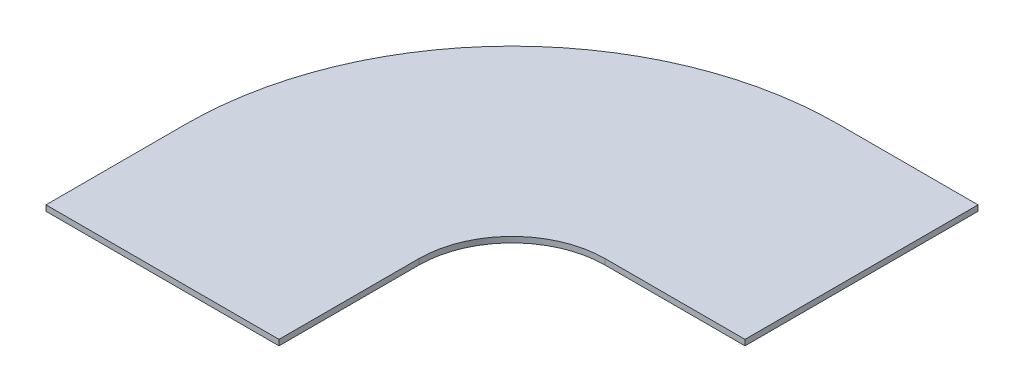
ISO-10303-21;
HEADER;
FILE_DESCRIPTION(('STEP AP214'),'2;1');
FILE_NAME('part.step','',(''),(''),'','','');
FILE_SCHEMA(('AUTOMOTIVE_DESIGN { 1 0 10303 214 1 1 1 1 }'));
ENDSEC;
DATA;
#1=APPLICATION_CONTEXT('core data for automotive mechanical design processes');
#2=APPLICATION_PROTOCOL_DEFINITION('international standard','automotive_design',2000,#1);
#3=PRODUCT_CONTEXT('',#1,'mechanical');
#4=PRODUCT('Part','Part','',(#3));
#5=PRODUCT_RELATED_PRODUCT_CATEGORY('part','',(#4));
#6=PRODUCT_DEFINITION_FORMATION('','',#4);
#7=PRODUCT_DEFINITION_CONTEXT('part definition',#1,'design');
#8=PRODUCT_DEFINITION('design','',#6,#7);
#9=PRODUCT_DEFINITION_SHAPE('','',#8);
#10=(LENGTH_UNIT() NAMED_UNIT(*) SI_UNIT(.MILLI.,.METRE.));
#11=(NAMED_UNIT(*) PLANE_ANGLE_UNIT() SI_UNIT($,.RADIAN.));
#12=(NAMED_UNIT(*) SI_UNIT($,.STERADIAN.) SOLID_ANGLE_UNIT());
#13=UNCERTAINTY_MEASURE_WITH_UNIT(LENGTH_MEASURE(1.E-05),#10,'distance_accuracy_value','');
#14=(GEOMETRIC_REPRESENTATION_CONTEXT(3) GLOBAL_UNCERTAINTY_ASSIGNED_CONTEXT((#13)) GLOBAL_UNIT_ASSIGNED_CONTEXT((#10,
#11,#12)) REPRESENTATION_CONTEXT('',''));
#15=CARTESIAN_POINT('',(0.,0.,0.));
#16=DIRECTION('',(0.,0.,1.));
#17=DIRECTION('',(1.,0.,0.));
#18=AXIS2_PLACEMENT_3D('',#15,#16,#17);
#19=CARTESIAN_POINT('',(50.,1.21412,0.));
#20=DIRECTION('',(0.,0.,-1.));
#21=DIRECTION('',(-1.,0.,0.));
#22=AXIS2_PLACEMENT_3D('',#19,#20,#21);
#23=PLANE('',#22);
#24=DIRECTION('',(1.,0.,0.));
#25=VECTOR('',#24,1.);
#26=CARTESIAN_POINT('',(50.,0.,0.));
#27=LINE('',#26,#25);
#28=CARTESIAN_POINT('',(0.,0.,0.));
#29=VERTEX_POINT('',#28);
#30=CARTESIAN_POINT('',(50.,0.,0.));
#31=VERTEX_POINT('',#30);
#32=EDGE_CURVE('E129',#29,#31,#27,.T.);
#33=ORIENTED_EDGE('',*,*,#32,.T.);
#34=DIRECTION('',(0.,-1.,0.));
#35=VECTOR('',#34,1.);
#36=CARTESIAN_POINT('',(50.,1.21412,0.));
#37=LINE('',#36,#35);
#38=CARTESIAN_POINT('',(50.,1.21412,0.));
#39=VERTEX_POINT('',#38);
#40=EDGE_CURVE('E11',#39,#31,#37,.T.);
#41=ORIENTED_EDGE('',*,*,#40,.F.);
#42=DIRECTION('',(1.,0.,0.));
#43=VECTOR('',#42,1.);
#44=CARTESIAN_POINT('',(50.,1.21412,0.));
#45=LINE('',#44,#43);
#46=CARTESIAN_POINT('',(0.,1.21412,0.));
#47=VERTEX_POINT('',#46);
#48=EDGE_CURVE('E143',#47,#39,#45,.T.);
#49=ORIENTED_EDGE('',*,*,#48,.F.);
#50=DIRECTION('',(0.,-1.,0.));
#51=VECTOR('',#50,1.);
#52=CARTESIAN_POINT('',(0.,1.21412,0.));
#53=LINE('',#52,#51);
#54=EDGE_CURVE('E125',#47,#29,#53,.T.);
#55=ORIENTED_EDGE('',*,*,#54,.T.);
#56=EDGE_LOOP('',(#33,#41,#49,#55));
#57=FACE_BOUND('',#56,.T.);
#58=ADVANCED_FACE('F33',(#57),#23,.F.);
#59=CARTESIAN_POINT('',(50.,1.21412,-30.));
#60=DIRECTION('',(-1.,0.,0.));
#61=DIRECTION('',(0.,0.,1.));
#62=AXIS2_PLACEMENT_3D('',#59,#60,#61);
#63=PLANE('',#62);
#64=DIRECTION('',(0.,0.,-1.));
#65=VECTOR('',#64,1.);
#66=CARTESIAN_POINT('',(50.,0.,-30.));
#67=LINE('',#66,#65);
#68=CARTESIAN_POINT('',(50.,0.,-30.));
#69=VERTEX_POINT('',#68);
#70=EDGE_CURVE('E132',#31,#69,#67,.T.);
#71=ORIENTED_EDGE('',*,*,#70,.T.);
#72=DIRECTION('',(0.,-1.,0.));
#73=VECTOR('',#72,1.);
#74=CARTESIAN_POINT('',(50.,1.21412,-30.));
#75=LINE('',#74,#73);
#76=CARTESIAN_POINT('',(50.,1.21412,-30.));
#77=VERTEX_POINT('',#76);
#78=EDGE_CURVE('E41',#77,#69,#75,.T.);
#79=ORIENTED_EDGE('',*,*,#78,.F.);
#80=DIRECTION('',(0.,0.,-1.));
#81=VECTOR('',#80,1.);
#82=CARTESIAN_POINT('',(50.,1.21412,-30.));
#83=LINE('',#82,#81);
#84=EDGE_CURVE('E92',#39,#77,#83,.T.);
#85=ORIENTED_EDGE('',*,*,#84,.F.);
#86=ORIENTED_EDGE('',*,*,#40,.T.);
#87=EDGE_LOOP('',(#71,#79,#85,#86));
#88=FACE_BOUND('',#87,.T.);
#89=ADVANCED_FACE('F178',(#88),#63,.F.);
#90=CARTESIAN_POINT('',(70.,1.21412,-30.));
#91=DIRECTION('',(0.,-1.,0.));
#92=DIRECTION('',(0.,0.,-1.));
#93=AXIS2_PLACEMENT_3D('',#90,#91,#92);
#94=CYLINDRICAL_SURFACE('',#93,20.);
#95=CARTESIAN_POINT('',(70.,0.,-30.));
#96=DIRECTION('',(0.,-1.,0.));
#97=DIRECTION('',(0.,0.,1.));
#98=AXIS2_PLACEMENT_3D('',#95,#96,#97);
#99=CIRCLE('',#98,20.);
#100=CARTESIAN_POINT('',(70.,0.,-50.));
#101=VERTEX_POINT('',#100);
#102=EDGE_CURVE('E134',#69,#101,#99,.T.);
#103=ORIENTED_EDGE('',*,*,#102,.T.);
#104=DIRECTION('',(0.,-1.,0.));
#105=VECTOR('',#104,1.);
#106=CARTESIAN_POINT('',(70.,1.21412,-50.));
#107=LINE('',#106,#105);
#108=CARTESIAN_POINT('',(70.,1.21412,-50.));
#109=VERTEX_POINT('',#108);
#110=EDGE_CURVE('E150',#109,#101,#107,.T.);
#111=ORIENTED_EDGE('',*,*,#110,.F.);
#112=CARTESIAN_POINT('',(70.,1.21412,-30.));
#113=DIRECTION('',(0.,-1.,0.));
#114=DIRECTION('',(0.,0.,1.));
#115=AXIS2_PLACEMENT_3D('',#112,#113,#114);
#116=CIRCLE('',#115,20.);
#117=EDGE_CURVE('E158',#77,#109,#116,.T.);
#118=ORIENTED_EDGE('',*,*,#117,.F.);
#119=ORIENTED_EDGE('',*,*,#78,.T.);
#120=EDGE_LOOP('',(#103,#111,#118,#119));
#121=FACE_BOUND('',#120,.T.);
#122=ADVANCED_FACE('F156',(#121),#94,.F.);
#123=CARTESIAN_POINT('',(100.,1.21412,-50.));
#124=DIRECTION('',(0.,0.,-1.));
#125=DIRECTION('',(-1.,0.,0.));
#126=AXIS2_PLACEMENT_3D('',#123,#124,#125);
#127=PLANE('',#126);
#128=DIRECTION('',(1.,0.,0.));
#129=VECTOR('',#128,1.);
#130=CARTESIAN_POINT('',(100.,0.,-50.));
#131=LINE('',#130,#129);
#132=CARTESIAN_POINT('',(100.,0.,-50.));
#133=VERTEX_POINT('',#132);
#134=EDGE_CURVE('E136',#101,#133,#131,.T.);
#135=ORIENTED_EDGE('',*,*,#134,.T.);
#136=DIRECTION('',(0.,-1.,0.));
#137=VECTOR('',#136,1.);
#138=CARTESIAN_POINT('',(100.,1.21412,-50.));
#139=LINE('',#138,#137);
#140=CARTESIAN_POINT('',(100.,1.21412,-50.));
#141=VERTEX_POINT('',#140);
#142=EDGE_CURVE('E147',#141,#133,#139,.T.);
#143=ORIENTED_EDGE('',*,*,#142,.F.);
#144=DIRECTION('',(1.,0.,0.));
#145=VECTOR('',#144,1.);
#146=CARTESIAN_POINT('',(100.,1.21412,-50.));
#147=LINE('',#146,#145);
#148=EDGE_CURVE('E170',#109,#141,#147,.T.);
#149=ORIENTED_EDGE('',*,*,#148,.F.);
#150=ORIENTED_EDGE('',*,*,#110,.T.);
#151=EDGE_LOOP('',(#135,#143,#149,#150));
#152=FACE_BOUND('',#151,.T.);
#153=ADVANCED_FACE('F166',(#152),#127,.F.);
#154=CARTESIAN_POINT('',(100.,1.21412,-100.));
#155=DIRECTION('',(-1.,0.,0.));
#156=DIRECTION('',(0.,0.,1.));
#157=AXIS2_PLACEMENT_3D('',#154,#155,#156);
#158=PLANE('',#157);
#159=DIRECTION('',(0.,0.,-1.));
#160=VECTOR('',#159,1.);
#161=CARTESIAN_POINT('',(100.,0.,-100.));
#162=LINE('',#161,#160);
#163=CARTESIAN_POINT('',(100.,0.,-100.));
#164=VERTEX_POINT('',#163);
#165=EDGE_CURVE('E138',#133,#164,#162,.T.);
#166=ORIENTED_EDGE('',*,*,#165,.T.);
#167=DIRECTION('',(0.,-1.,0.));
#168=VECTOR('',#167,1.);
#169=CARTESIAN_POINT('',(100.,1.21412,-100.));
#170=LINE('',#169,#168);
#171=CARTESIAN_POINT('',(100.,1.21412,-100.));
#172=VERTEX_POINT('',#171);
#173=EDGE_CURVE('E120',#172,#164,#170,.T.);
#174=ORIENTED_EDGE('',*,*,#173,.F.);
#175=DIRECTION('',(0.,0.,-1.));
#176=VECTOR('',#175,1.);
#177=CARTESIAN_POINT('',(100.,1.21412,-100.));
#178=LINE('',#177,#176);
#179=EDGE_CURVE('E111',#141,#172,#178,.T.);
#180=ORIENTED_EDGE('',*,*,#179,.F.);
#181=ORIENTED_EDGE('',*,*,#142,.T.);
#182=EDGE_LOOP('',(#166,#174,#180,#181));
#183=FACE_BOUND('',#182,.T.);
#184=ADVANCED_FACE('F169',(#183),#158,.F.);
#185=CARTESIAN_POINT('',(70.,1.21412,-100.));
#186=DIRECTION('',(0.,0.,1.));
#187=DIRECTION('',(1.,0.,0.));
#188=AXIS2_PLACEMENT_3D('',#185,#186,#187);
#189=PLANE('',#188);
#190=DIRECTION('',(-1.,0.,0.));
#191=VECTOR('',#190,1.);
#192=CARTESIAN_POINT('',(70.,0.,-100.));
#193=LINE('',#192,#191);
#194=CARTESIAN_POINT('',(70.,0.,-100.));
#195=VERTEX_POINT('',#194);
#196=EDGE_CURVE('E119',#164,#195,#193,.T.);
#197=ORIENTED_EDGE('',*,*,#196,.T.);
#198=DIRECTION('',(0.,-1.,0.));
#199=VECTOR('',#198,1.);
#200=CARTESIAN_POINT('',(70.,1.21412,-100.));
#201=LINE('',#200,#199);
#202=CARTESIAN_POINT('',(70.,1.21412,-100.));
#203=VERTEX_POINT('',#202);
#204=EDGE_CURVE('E116',#203,#195,#201,.T.);
#205=ORIENTED_EDGE('',*,*,#204,.F.);
#206=DIRECTION('',(-1.,0.,0.));
#207=VECTOR('',#206,1.);
#208=CARTESIAN_POINT('',(70.,1.21412,-100.));
#209=LINE('',#208,#207);
#210=EDGE_CURVE('E105',#172,#203,#209,.T.);
#211=ORIENTED_EDGE('',*,*,#210,.F.);
#212=ORIENTED_EDGE('',*,*,#173,.T.);
#213=EDGE_LOOP('',(#197,#205,#211,#212));
#214=FACE_BOUND('',#213,.T.);
#215=ADVANCED_FACE('F117',(#214),#189,.F.);
#216=CARTESIAN_POINT('',(70.,1.21412,-30.));
#217=DIRECTION('',(0.,-1.,0.));
#218=DIRECTION('',(0.,0.,-1.));
#219=AXIS2_PLACEMENT_3D('',#216,#217,#218);
#220=CYLINDRICAL_SURFACE('',#219,70.);
#221=CARTESIAN_POINT('',(70.,0.,-30.));
#222=DIRECTION('',(0.,1.,0.));
#223=DIRECTION('',(0.,0.,-1.));
#224=AXIS2_PLACEMENT_3D('',#221,#222,#223);
#225=CIRCLE('',#224,70.);
#226=CARTESIAN_POINT('',(0.,0.,-30.));
#227=VERTEX_POINT('',#226);
#228=EDGE_CURVE('E78',#195,#227,#225,.T.);
#229=ORIENTED_EDGE('',*,*,#228,.T.);
#230=DIRECTION('',(0.,-1.,0.));
#231=VECTOR('',#230,1.);
#232=CARTESIAN_POINT('',(0.,1.21412,-30.));
#233=LINE('',#232,#231);
#234=CARTESIAN_POINT('',(0.,1.21412,-30.));
#235=VERTEX_POINT('',#234);
#236=EDGE_CURVE('E121',#235,#227,#233,.T.);
#237=ORIENTED_EDGE('',*,*,#236,.F.);
#238=CARTESIAN_POINT('',(70.,1.21412,-30.));
#239=DIRECTION('',(0.,1.,0.));
#240=DIRECTION('',(0.,0.,-1.));
#241=AXIS2_PLACEMENT_3D('',#238,#239,#240);
#242=CIRCLE('',#241,70.);
#243=EDGE_CURVE('E109',#203,#235,#242,.T.);
#244=ORIENTED_EDGE('',*,*,#243,.F.);
#245=ORIENTED_EDGE('',*,*,#204,.T.);
#246=EDGE_LOOP('',(#229,#237,#244,#245));
#247=FACE_BOUND('',#246,.T.);
#248=ADVANCED_FACE('F123',(#247),#220,.T.);
#249=CARTESIAN_POINT('',(0.,1.21412,0.));
#250=DIRECTION('',(1.,0.,0.));
#251=DIRECTION('',(0.,0.,-1.));
#252=AXIS2_PLACEMENT_3D('',#249,#250,#251);
#253=PLANE('',#252);
#254=DIRECTION('',(0.,0.,1.));
#255=VECTOR('',#254,1.);
#256=CARTESIAN_POINT('',(0.,0.,0.));
#257=LINE('',#256,#255);
#258=EDGE_CURVE('E84',#227,#29,#257,.T.);
#259=ORIENTED_EDGE('',*,*,#258,.T.);
#260=ORIENTED_EDGE('',*,*,#54,.F.);
#261=DIRECTION('',(0.,0.,1.));
#262=VECTOR('',#261,1.);
#263=CARTESIAN_POINT('',(0.,1.21412,0.));
#264=LINE('',#263,#262);
#265=EDGE_CURVE('E49',#235,#47,#264,.T.);
#266=ORIENTED_EDGE('',*,*,#265,.F.);
#267=ORIENTED_EDGE('',*,*,#236,.T.);
#268=EDGE_LOOP('',(#259,#260,#266,#267));
#269=FACE_BOUND('',#268,.T.);
#270=ADVANCED_FACE('F194',(#269),#253,.F.);
#271=CARTESIAN_POINT('',(70.,1.21412,-30.));
#272=DIRECTION('',(0.,-1.,0.));
#273=DIRECTION('',(0.,0.,-1.));
#274=AXIS2_PLACEMENT_3D('',#271,#272,#273);
#275=PLANE('',#274);
#276=ORIENTED_EDGE('',*,*,#48,.T.);
#277=ORIENTED_EDGE('',*,*,#84,.T.);
#278=ORIENTED_EDGE('',*,*,#117,.T.);
#279=ORIENTED_EDGE('',*,*,#148,.T.);
#280=ORIENTED_EDGE('',*,*,#179,.T.);
#281=ORIENTED_EDGE('',*,*,#210,.T.);
#282=ORIENTED_EDGE('',*,*,#243,.T.);
#283=ORIENTED_EDGE('',*,*,#265,.T.);
#284=EDGE_LOOP('',(#276,#277,#278,#279,#280,#281,#282,#283));
#285=FACE_BOUND('',#284,.T.);
#286=ADVANCED_FACE('F107',(#285),#275,.F.);
#287=CARTESIAN_POINT('',(70.,0.,-30.));
#288=DIRECTION('',(0.,-1.,0.));
#289=DIRECTION('',(0.,0.,-1.));
#290=AXIS2_PLACEMENT_3D('',#287,#288,#289);
#291=PLANE('',#290);
#292=ORIENTED_EDGE('',*,*,#32,.F.);
#293=ORIENTED_EDGE('',*,*,#258,.F.);
#294=ORIENTED_EDGE('',*,*,#228,.F.);
#295=ORIENTED_EDGE('',*,*,#196,.F.);
#296=ORIENTED_EDGE('',*,*,#165,.F.);
#297=ORIENTED_EDGE('',*,*,#134,.F.);
#298=ORIENTED_EDGE('',*,*,#102,.F.);
#299=ORIENTED_EDGE('',*,*,#70,.F.);
#300=EDGE_LOOP('',(#292,#293,#294,#295,#296,#297,#298,#299));
#301=FACE_BOUND('',#300,.T.);
#302=ADVANCED_FACE('F162',(#301),#291,.T.);
#303=CLOSED_SHELL('',(#58,#89,#122,#153,#184,#215,#248,#270,#286,#302));
#304=MANIFOLD_SOLID_BREP('B2',#303);
#305=ADVANCED_BREP_SHAPE_REPRESENTATION('',(#18,#304),#14);
#306=SHAPE_DEFINITION_REPRESENTATION(#9,#305);
ENDSEC;
END-ISO-10303-21;
